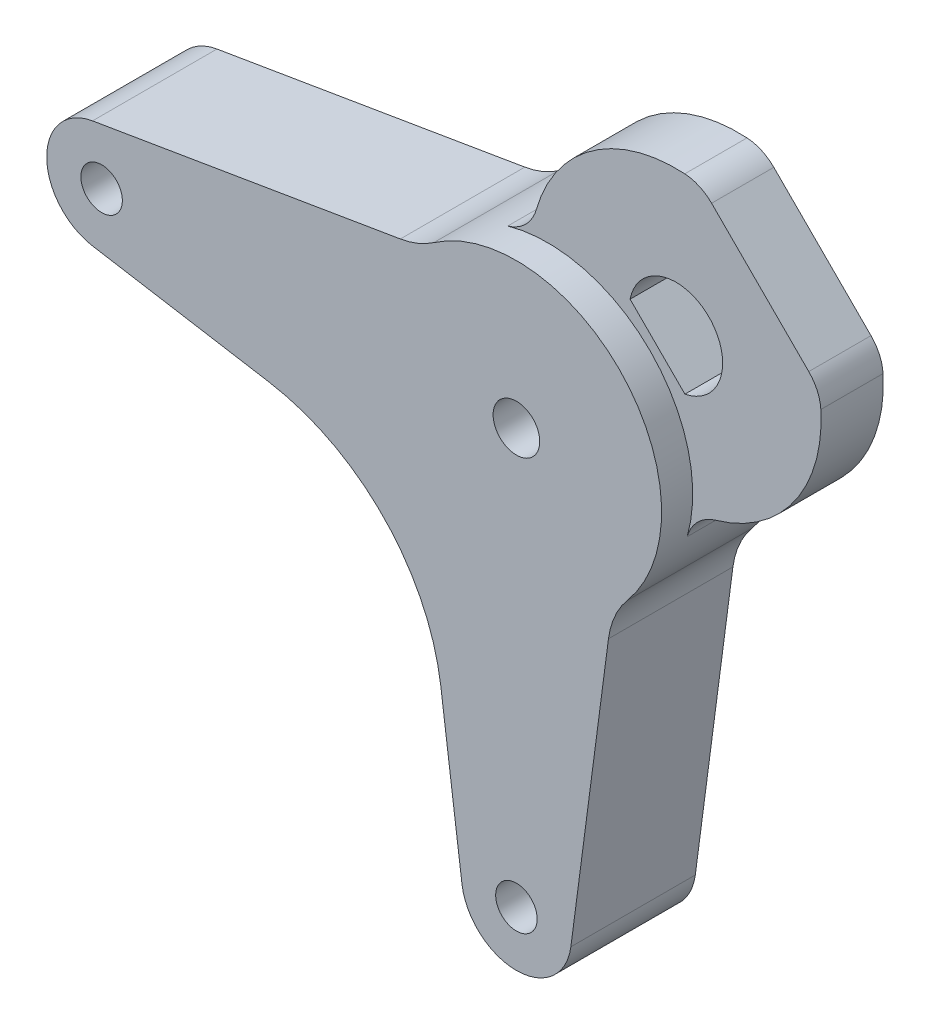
from build123d import *

# Parameters (mm, degrees)
EXTRUDE1_DEPTH     = 19.05
EXTRUDE2_DEPTH     = 9.525
SKETCH1_6_R        = 7.14375
SKETCH1_6_R_2      = 6.35
CUT_EXTRUDE3_DEPTH = 19.05
FILLET1_R          = 12.7


with BuildPart() as part:
    # Sketch1 → Extrude1 (new, symmetric)
    with BuildSketch(Plane.XY):
        with BuildLine():
            Line((167.603252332, 45.416896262), (179.115213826, 132.858925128))
            ThreePointArc((179.115213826, 132.858925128), (181.065244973, 139.810162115), (184.892237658, 145.931962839))
            ThreePointArc((184.892237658, 145.931962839), (183.837882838, 204.495199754), (125.646600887, 211.168960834))
            ThreePointArc((125.646600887, 211.168960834), (120.752801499, 208.524640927), (115.400738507, 207.009014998))
            Line((115.400738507, 207.009014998), (21.149845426, 191.194653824))
            ThreePointArc((21.149845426, 191.194653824), (7.117505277, 174.611668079), (21.149845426, 158.028682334))
            Line((21.149845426, 158.028682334), (75.337254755, 148.936574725))
            ThreePointArc((75.337254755, 148.936574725), (110.517150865, 130.412871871), (127.78622456, 94.600419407))
            Line((127.78622456, 94.600419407), (134.261358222, 45.416896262))
            ThreePointArc((134.261358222, 45.416896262), (150.932305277, 30.796868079), (167.603252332, 45.416896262))
        make_face()
    extrude(amount=EXTRUDE1_DEPTH, both=True)

    # Sketch1_3 → Extrude2 (add, symmetric)
    with BuildSketch(Plane.XY):
        with BuildLine():
            ThreePointArc((146.062865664, 218.794142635), (182.3632017, 206.042564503), (195.114779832, 169.742228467))
            ThreePointArc((195.114779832, 169.742228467), (225.847001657, 187.310342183), (233.999674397, 221.758012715))
            Line((233.999674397, 221.758012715), (198.078649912, 257.679037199))
            ThreePointArc((198.078649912, 257.679037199), (163.630979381, 249.52636446), (146.062865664, 218.794142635))
        make_face()
        with BuildLine():
            Line((193.002981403, 199.892912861), (176.213550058, 216.682344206))
            ThreePointArc((176.213550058, 216.682344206), (200.357108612, 224.036471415), (193.002981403, 199.892912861))
        make_face(mode=Mode.SUBTRACT)
    extrude(amount=EXTRUDE2_DEPTH, both=True)

    # Sketch1_6 → Cut-Extrude3 (cut, symmetric)
    with BuildSketch(Plane.XY):
        with Locations((150.932305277, 174.611668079)):
            Circle(SKETCH1_6_R)
        with Locations((150.932305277, 47.611668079)):
            Circle(SKETCH1_6_R_2)
        with Locations((23.932305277, 174.611668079)):
            Circle(SKETCH1_6_R_2)
    extrude(amount=CUT_EXTRUDE3_DEPTH, both=True, mode=Mode.SUBTRACT)

    # Fillet1
    fillet1_edges = [part.edges().sort_by_distance(p)[0] for p in [
        (146.062865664, 218.794142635, 0),
        (195.114779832, 169.742228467, 0),
        (233.999674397, 221.758012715, 0),
        (198.078649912, 257.679037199, 0),
    ]]
    fillet(fillet1_edges, radius=FILLET1_R)


solid = part.part
